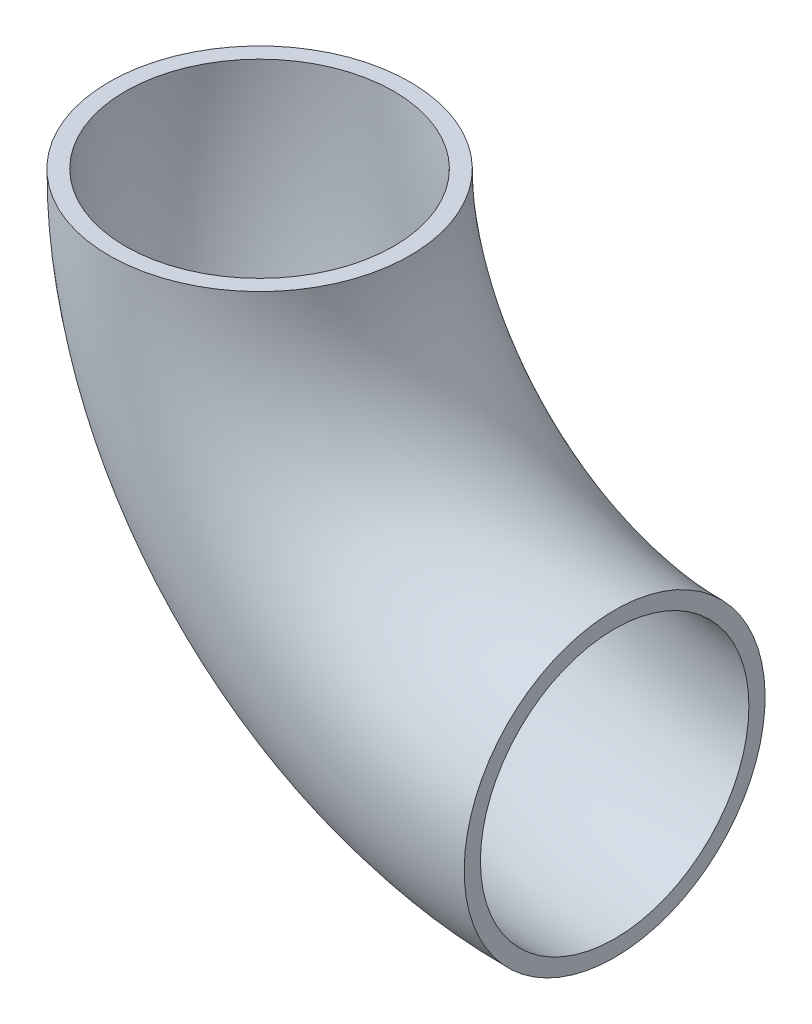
from build123d import *

# Parameters (mm, degrees)
ESQUISSE2_R   = 24.15
ESQUISSE2_R_2 = 21.55


with BuildPart() as part:
    # Balayage-Mince1: sweep along a path in Esquisse1
    with BuildLine(Plane.XY) as balayage_mince1_path:
        ThreePointArc((500, -358), (516.694913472, -398.305086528), (557, -415))
    # Esquisse2 → Balayage-Mince1 (sweep)
    with BuildSketch(Plane.XZ.offset(358)):
        with Locations((500, 0)):
            Circle(ESQUISSE2_R)
        with Locations((500, 0)):
            Circle(ESQUISSE2_R_2, mode=Mode.SUBTRACT)
    sweep(path=balayage_mince1_path.line)


solid = part.part
